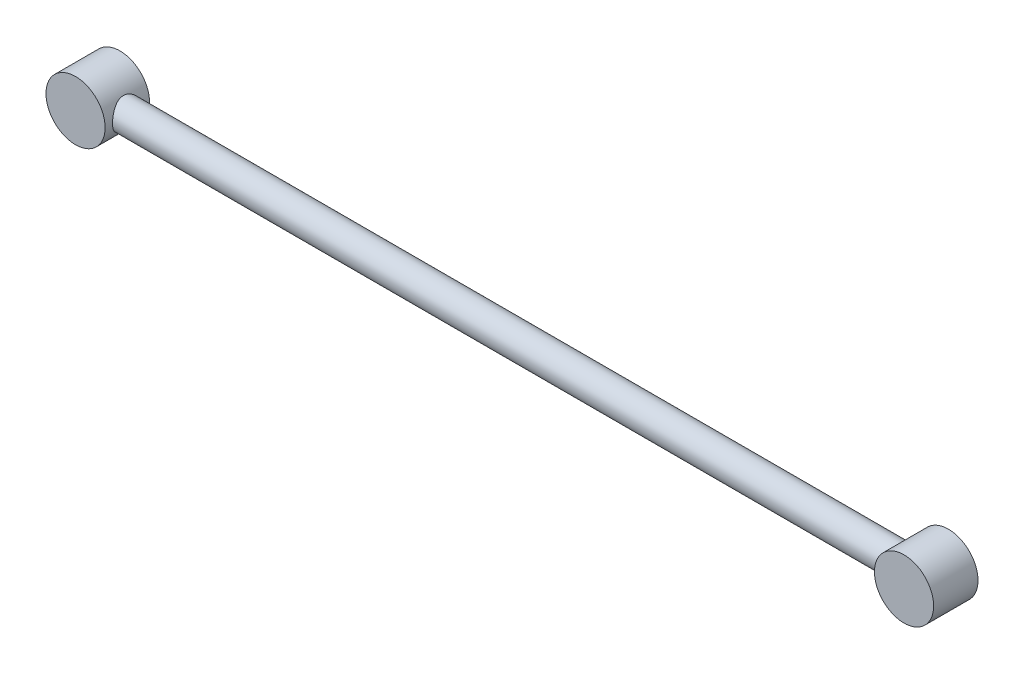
from build123d import *

# Parameters (mm, degrees)
SKETCH1_R                            = 12.7
BOSS_EXTRUDE1_DEPTH                  = 9.525
BOSS_EXTRUDE1_2_DEPTH                = 9.525
BOSS_EXTRUDE2_REACH                  = 193.16
BOSS_EXTRUDE2_END_RADIUS             = 12.7
SKETCH2_R                            = 6.35
BOSS_EXTRUDE2_DIRECTION_2_REACH      = 193.16
BOSS_EXTRUDE2_DIRECTION_2_END_RADIUS = 12.7


with BuildPart() as part:
    # Sketch1 → Boss-Extrude1 (new, symmetric)
    with BuildSketch(Plane.XY):
        with Locations(Location((-177.8, 0, 0), (0, 0, 180))):
            Circle(SKETCH1_R)
    extrude(amount=BOSS_EXTRUDE1_DEPTH, both=True)



with BuildPart() as body_2:
    # Sketch1 → Boss-Extrude1 2 (new, symmetric)
    with BuildSketch(Plane.XY):
        with Locations(Location((177.8, 0, 0), (0, 0, 180))):
            Circle(SKETCH1_R)
    extrude(amount=BOSS_EXTRUDE1_2_DEPTH, both=True)


with BuildPart() as part_1:
    add(part.part)

    add(body_2.part)  # Boss-Extrude2 merges body 2
    # Boss-Extrude2: up to this cylinder (the profile starts outside it)
    boss_extrude2_end = Plane(origin=(177.8, 0, 0), z_dir=(0, 0, -1)) * Cylinder(BOSS_EXTRUDE2_END_RADIUS, 412.72, mode=Mode.PRIVATE)
    # Sketch2 → Boss-Extrude2 (add, up to the surface)
    with BuildSketch(Plane(origin=(0, 0, 0), x_dir=(0, 0, -1), z_dir=(1, 0, 0)), mode=Mode.PRIVATE) as boss_extrude2_sk1:
        with Locations(Location((0, 0, 0), (0, 0, 180))):
            Circle(SKETCH2_R)
    boss_extrude2_tool1 = extrude(boss_extrude2_sk1.sketch, amount=BOSS_EXTRUDE2_REACH, mode=Mode.PRIVATE) - boss_extrude2_end
    add(boss_extrude2_tool1.solids().sort_by_distance((0, 0, 0))[0])

    # Boss-Extrude2 direction 2: up to this cylinder (the profile starts outside it)
    boss_extrude2_direction_2_end = Plane(origin=(-177.8, 0, 0), z_dir=(0, 0, -1)) * Cylinder(BOSS_EXTRUDE2_DIRECTION_2_END_RADIUS, 412.72, mode=Mode.PRIVATE)
    # Sketch2 → Boss-Extrude2 direction 2 (add, up to the surface)
    with BuildSketch(Plane(origin=(0, 0, 0), x_dir=(0, 0, -1), z_dir=(1, 0, 0)), mode=Mode.PRIVATE) as boss_extrude2_direction_2_sk1:
        with Locations(Location((0, 0, 0), (0, 0, 180))):
            Circle(SKETCH2_R)
    boss_extrude2_direction_2_tool1 = extrude(boss_extrude2_direction_2_sk1.sketch, amount=-BOSS_EXTRUDE2_DIRECTION_2_REACH, mode=Mode.PRIVATE) - boss_extrude2_direction_2_end
    add(boss_extrude2_direction_2_tool1.solids().sort_by_distance((0, 0, 0))[0])


solid = part_1.part
